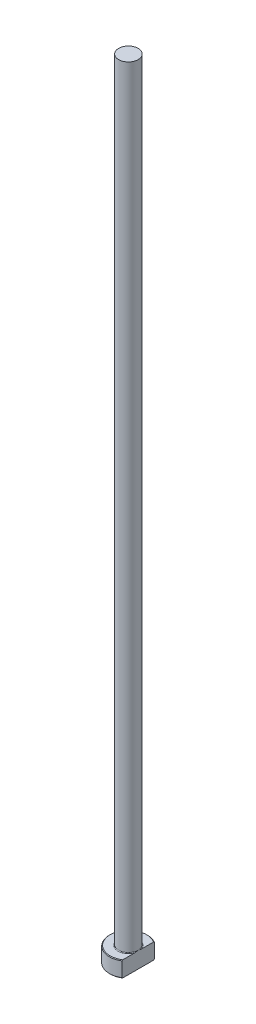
from build123d import *
from build123d.topology import SkipClean

# Parameters (mm, degrees)
CHAMFER1_SIZE = 0.2
FILLET1_R     = 0.2
KEY_DEPTH     = 251.143958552


with BuildPart() as part:
    # Sketch1 → Revolve1 (revolve)
    with BuildSketch(Plane.XY, mode=Mode.PRIVATE) as revolve1_sk:
        Polygon((0, 0), (-6, 0), (-6, 5), (-3.1, 5), (-3.1, 250), (0, 250), align=None)
    revolve(revolve1_sk.sketch.rotate(Axis((0, 259.958771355, 0), (0, -1, 0)), 270), axis=Axis((0, 259.958771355, 0), (0, -1, 0)))

    # Chamfer1
    chamfer1_edges = [part.edges().sort_by_distance(p)[0] for p in [
        (0, 5, -6),
        (0, 0, -6),
    ]]
    chamfer(chamfer1_edges, length=CHAMFER1_SIZE)

    # Fillet1
    fillet1_edges = [part.edges().sort_by_distance(p)[0] for p in [
        (0, 5, -3.1),
    ]]
    fillet(fillet1_edges, radius=FILLET1_R)

    # Sketch2 → KEY (cut, through all)
    with SkipClean():  # the faces are left unmerged after this step: merging them gives an invalid solid
        with BuildSketch(Plane(origin=(0, 0, 0), x_dir=(1, 0, 0), z_dir=(0, 1, 0))):
            with BuildLine():
                Line((3.1, 5.137119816), (3.1, -5.137119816))
                ThreePointArc((3.1, -5.137119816), (6, 0), (3.1, 5.137119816))
            make_face()
        extrude(amount=KEY_DEPTH, mode=Mode.SUBTRACT)


solid = part.part
